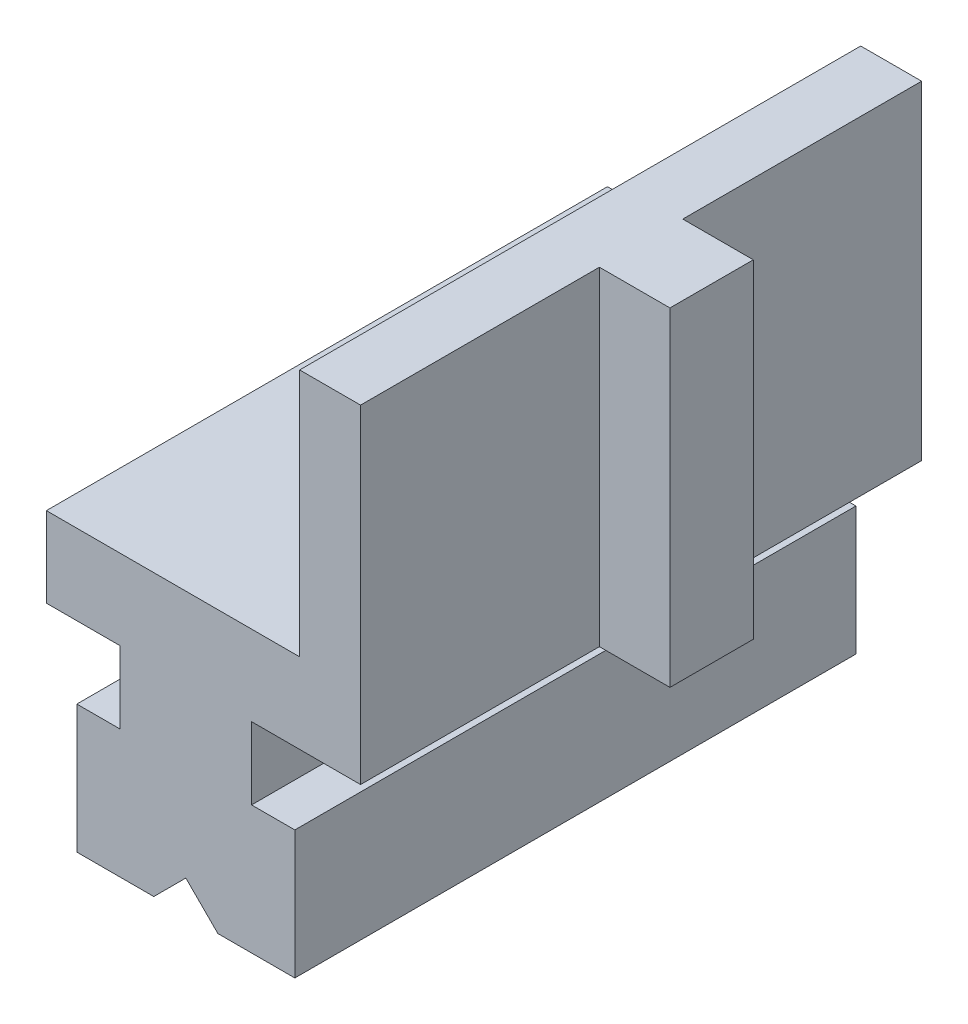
ISO-10303-21;
HEADER;
FILE_DESCRIPTION(('STEP AP214'),'2;1');
FILE_NAME('part.step','',(''),(''),'','','');
FILE_SCHEMA(('AUTOMOTIVE_DESIGN { 1 0 10303 214 1 1 1 1 }'));
ENDSEC;
DATA;
#1=APPLICATION_CONTEXT('core data for automotive mechanical design processes');
#2=APPLICATION_PROTOCOL_DEFINITION('international standard','automotive_design',2000,#1);
#3=PRODUCT_CONTEXT('',#1,'mechanical');
#4=PRODUCT('Part','Part','',(#3));
#5=PRODUCT_RELATED_PRODUCT_CATEGORY('part','',(#4));
#6=PRODUCT_DEFINITION_FORMATION('','',#4);
#7=PRODUCT_DEFINITION_CONTEXT('part definition',#1,'design');
#8=PRODUCT_DEFINITION('design','',#6,#7);
#9=PRODUCT_DEFINITION_SHAPE('','',#8);
#10=(LENGTH_UNIT() NAMED_UNIT(*) SI_UNIT(.MILLI.,.METRE.));
#11=(NAMED_UNIT(*) PLANE_ANGLE_UNIT() SI_UNIT($,.RADIAN.));
#12=(NAMED_UNIT(*) SI_UNIT($,.STERADIAN.) SOLID_ANGLE_UNIT());
#13=UNCERTAINTY_MEASURE_WITH_UNIT(LENGTH_MEASURE(1.E-05),#10,'distance_accuracy_value','');
#14=(GEOMETRIC_REPRESENTATION_CONTEXT(3) GLOBAL_UNCERTAINTY_ASSIGNED_CONTEXT((#13)) GLOBAL_UNIT_ASSIGNED_CONTEXT((#10,
#11,#12)) REPRESENTATION_CONTEXT('',''));
#15=CARTESIAN_POINT('',(0.,0.,0.));
#16=DIRECTION('',(0.,0.,1.));
#17=DIRECTION('',(1.,0.,0.));
#18=AXIS2_PLACEMENT_3D('',#15,#16,#17);
#19=CARTESIAN_POINT('',(15.3000049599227,20.5000076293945,-2.6));
#20=DIRECTION('',(0.,0.,1.));
#21=DIRECTION('',(1.,0.,0.));
#22=AXIS2_PLACEMENT_3D('',#19,#20,#21);
#23=PLANE('',#22);
#24=DIRECTION('',(1.,0.,0.));
#25=VECTOR('',#24,1.);
#26=CARTESIAN_POINT('',(7.10000801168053,20.5000076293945,-2.6));
#27=LINE('',#26,#25);
#28=CARTESIAN_POINT('',(15.3000049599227,20.5000076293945,-2.6));
#29=VERTEX_POINT('',#28);
#30=CARTESIAN_POINT('',(10.9000049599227,20.5000076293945,-2.6));
#31=VERTEX_POINT('',#30);
#32=EDGE_CURVE('E124',#29,#31,#27,.F.);
#33=ORIENTED_EDGE('',*,*,#32,.F.);
#34=DIRECTION('',(-3.72165448E-07,0.999999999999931,0.));
#35=VECTOR('',#34,1.);
#36=CARTESIAN_POINT('',(15.3000049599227,20.5000076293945,-2.6));
#37=LINE('',#36,#35);
#38=CARTESIAN_POINT('',(15.3000125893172,0.,-2.6));
#39=VERTEX_POINT('',#38);
#40=EDGE_CURVE('E18',#39,#29,#37,.T.);
#41=ORIENTED_EDGE('',*,*,#40,.F.);
#42=DIRECTION('',(1.,0.,0.));
#43=VECTOR('',#42,1.);
#44=CARTESIAN_POINT('',(15.3000125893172,0.,-2.6));
#45=LINE('',#44,#43);
#46=CARTESIAN_POINT('',(10.9000125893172,-8.18763986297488E-07,-2.59999999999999));
#47=VERTEX_POINT('',#46);
#48=EDGE_CURVE('E121',#47,#39,#45,.T.);
#49=ORIENTED_EDGE('',*,*,#48,.F.);
#50=DIRECTION('',(-3.72165448E-07,0.999999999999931,0.));
#51=VECTOR('',#50,1.);
#52=CARTESIAN_POINT('',(10.9000087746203,10.2500021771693,-2.59999999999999));
#53=LINE('',#52,#51);
#54=EDGE_CURVE('E264',#31,#47,#53,.F.);
#55=ORIENTED_EDGE('',*,*,#54,.F.);
#56=EDGE_LOOP('',(#33,#41,#49,#55));
#57=FACE_BOUND('',#56,.T.);
#58=ADVANCED_FACE('F15',(#57),#23,.F.);
#59=CARTESIAN_POINT('',(15.3000125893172,0.,2.6));
#60=DIRECTION('',(0.,0.,-1.));
#61=DIRECTION('',(-1.,0.,0.));
#62=AXIS2_PLACEMENT_3D('',#59,#60,#61);
#63=PLANE('',#62);
#64=DIRECTION('',(1.,0.,0.));
#65=VECTOR('',#64,1.);
#66=CARTESIAN_POINT('',(15.3000125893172,0.,2.6));
#67=LINE('',#66,#65);
#68=CARTESIAN_POINT('',(15.3000125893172,0.,2.6));
#69=VERTEX_POINT('',#68);
#70=CARTESIAN_POINT('',(10.9000125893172,0.,2.6));
#71=VERTEX_POINT('',#70);
#72=EDGE_CURVE('E135',#69,#71,#67,.F.);
#73=ORIENTED_EDGE('',*,*,#72,.F.);
#74=DIRECTION('',(-3.72165448E-07,0.999999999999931,0.));
#75=VECTOR('',#74,1.);
#76=CARTESIAN_POINT('',(15.3000049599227,20.5000076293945,2.6));
#77=LINE('',#76,#75);
#78=CARTESIAN_POINT('',(15.3000049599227,20.5000076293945,2.6));
#79=VERTEX_POINT('',#78);
#80=EDGE_CURVE('E128',#79,#69,#77,.F.);
#81=ORIENTED_EDGE('',*,*,#80,.F.);
#82=DIRECTION('',(1.,0.,0.));
#83=VECTOR('',#82,1.);
#84=CARTESIAN_POINT('',(7.10000801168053,20.5000076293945,2.6));
#85=LINE('',#84,#83);
#86=CARTESIAN_POINT('',(10.9000049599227,20.5000076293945,2.6));
#87=VERTEX_POINT('',#86);
#88=EDGE_CURVE('E201',#87,#79,#85,.T.);
#89=ORIENTED_EDGE('',*,*,#88,.F.);
#90=DIRECTION('',(-3.72165448E-07,0.999999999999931,0.));
#91=VECTOR('',#90,1.);
#92=CARTESIAN_POINT('',(10.9000087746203,10.2500021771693,2.59999999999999));
#93=LINE('',#92,#91);
#94=EDGE_CURVE('E149',#71,#87,#93,.T.);
#95=ORIENTED_EDGE('',*,*,#94,.F.);
#96=EDGE_LOOP('',(#73,#81,#89,#95));
#97=FACE_BOUND('',#96,.T.);
#98=ADVANCED_FACE('F376',(#97),#63,.F.);
#99=CARTESIAN_POINT('',(15.3000049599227,20.5000076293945,0.));
#100=DIRECTION('',(0.999999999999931,3.72165448E-07,0.));
#101=DIRECTION('',(-3.72165448E-07,0.999999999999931,0.));
#102=AXIS2_PLACEMENT_3D('',#99,#100,#101);
#103=PLANE('',#102);
#104=ORIENTED_EDGE('',*,*,#80,.T.);
#105=DIRECTION('',(0.,0.,-1.));
#106=VECTOR('',#105,1.);
#107=CARTESIAN_POINT('',(15.3000125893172,0.,0.));
#108=LINE('',#107,#106);
#109=EDGE_CURVE('E130',#39,#69,#108,.F.);
#110=ORIENTED_EDGE('',*,*,#109,.F.);
#111=ORIENTED_EDGE('',*,*,#40,.T.);
#112=DIRECTION('',(0.,0.,1.));
#113=VECTOR('',#112,1.);
#114=CARTESIAN_POINT('',(15.3000049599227,20.5000076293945,0.));
#115=LINE('',#114,#113);
#116=EDGE_CURVE('E231',#79,#29,#115,.F.);
#117=ORIENTED_EDGE('',*,*,#116,.F.);
#118=EDGE_LOOP('',(#104,#110,#111,#117));
#119=FACE_BOUND('',#118,.T.);
#120=ADVANCED_FACE('F131',(#119),#103,.T.);
#121=CARTESIAN_POINT('',(10.9000087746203,10.2500021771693,10.05));
#122=DIRECTION('',(0.999999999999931,3.72165448E-07,0.));
#123=DIRECTION('',(-3.72165448E-07,0.999999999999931,0.));
#124=AXIS2_PLACEMENT_3D('',#121,#122,#123);
#125=PLANE('',#124);
#126=DIRECTION('',(-3.72165448E-07,0.999999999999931,0.));
#127=VECTOR('',#126,1.);
#128=CARTESIAN_POINT('',(10.9000116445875,2.53846630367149,17.5));
#129=LINE('',#128,#127);
#130=CARTESIAN_POINT('',(10.9000125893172,0.,17.5));
#131=VERTEX_POINT('',#130);
#132=CARTESIAN_POINT('',(10.9000049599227,20.5000076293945,17.5));
#133=VERTEX_POINT('',#132);
#134=EDGE_CURVE('E206',#131,#133,#129,.T.);
#135=ORIENTED_EDGE('',*,*,#134,.F.);
#136=DIRECTION('',(0.,0.,-1.));
#137=VECTOR('',#136,1.);
#138=CARTESIAN_POINT('',(10.9000125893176,0.,0.));
#139=LINE('',#138,#137);
#140=EDGE_CURVE('E208',#71,#131,#139,.F.);
#141=ORIENTED_EDGE('',*,*,#140,.F.);
#142=ORIENTED_EDGE('',*,*,#94,.T.);
#143=DIRECTION('',(0.,0.,1.));
#144=VECTOR('',#143,1.);
#145=CARTESIAN_POINT('',(10.900004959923,20.5000076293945,0.));
#146=LINE('',#145,#144);
#147=EDGE_CURVE('E198',#133,#87,#146,.F.);
#148=ORIENTED_EDGE('',*,*,#147,.F.);
#149=EDGE_LOOP('',(#135,#141,#142,#148));
#150=FACE_BOUND('',#149,.T.);
#151=ADVANCED_FACE('F374',(#150),#125,.T.);
#152=CARTESIAN_POINT('',(1.99999409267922,-12.5,17.5));
#153=DIRECTION('',(0.707106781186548,0.707106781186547,0.));
#154=DIRECTION('',(-0.707106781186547,0.707106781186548,0.));
#155=AXIS2_PLACEMENT_3D('',#152,#153,#154);
#156=PLANE('',#155);
#157=DIRECTION('',(0.,0.,-1.));
#158=VECTOR('',#157,1.);
#159=CARTESIAN_POINT('',(1.99999409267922,-12.5,0.));
#160=LINE('',#159,#158);
#161=CARTESIAN_POINT('',(1.99999409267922,-12.5,17.5));
#162=VERTEX_POINT('',#161);
#163=CARTESIAN_POINT('',(1.99999409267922,-12.5,-17.5));
#164=VERTEX_POINT('',#163);
#165=EDGE_CURVE('E150',#162,#164,#160,.T.);
#166=ORIENTED_EDGE('',*,*,#165,.F.);
#167=DIRECTION('',(0.707106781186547,-0.707106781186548,0.));
#168=VECTOR('',#167,1.);
#169=CARTESIAN_POINT('',(-5.90732077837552E-06,-10.5,17.5));
#170=LINE('',#169,#168);
#171=CARTESIAN_POINT('',(-5.90732077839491E-06,-10.5,17.5));
#172=VERTEX_POINT('',#171);
#173=EDGE_CURVE('E222',#172,#162,#170,.T.);
#174=ORIENTED_EDGE('',*,*,#173,.F.);
#175=DIRECTION('',(0.,0.,1.));
#176=VECTOR('',#175,1.);
#177=CARTESIAN_POINT('',(-5.907320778E-06,-10.5,17.5));
#178=LINE('',#177,#176);
#179=CARTESIAN_POINT('',(-5.90732077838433E-06,-10.5,-17.5));
#180=VERTEX_POINT('',#179);
#181=EDGE_CURVE('E177',#172,#180,#178,.F.);
#182=ORIENTED_EDGE('',*,*,#181,.T.);
#183=DIRECTION('',(0.707106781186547,-0.707106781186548,0.));
#184=VECTOR('',#183,1.);
#185=CARTESIAN_POINT('',(-5.90732077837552E-06,-10.5,-17.5));
#186=LINE('',#185,#184);
#187=EDGE_CURVE('E168',#180,#164,#186,.T.);
#188=ORIENTED_EDGE('',*,*,#187,.T.);
#189=EDGE_LOOP('',(#166,#174,#182,#188));
#190=FACE_BOUND('',#189,.T.);
#191=ADVANCED_FACE('F434',(#190),#156,.F.);
#192=CARTESIAN_POINT('',(6.80000495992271,-12.5,0.));
#193=DIRECTION('',(0.,-1.,0.));
#194=DIRECTION('',(0.,0.,-1.));
#195=AXIS2_PLACEMENT_3D('',#192,#193,#194);
#196=PLANE('',#195);
#197=DIRECTION('',(0.,0.,-1.));
#198=VECTOR('',#197,1.);
#199=CARTESIAN_POINT('',(6.80000495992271,-12.5,0.));
#200=LINE('',#199,#198);
#201=CARTESIAN_POINT('',(6.80000495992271,-12.5,17.5));
#202=VERTEX_POINT('',#201);
#203=CARTESIAN_POINT('',(6.80000495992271,-12.5,-17.5));
#204=VERTEX_POINT('',#203);
#205=EDGE_CURVE('E155',#202,#204,#200,.T.);
#206=ORIENTED_EDGE('',*,*,#205,.F.);
#207=DIRECTION('',(1.,0.,0.));
#208=VECTOR('',#207,1.);
#209=CARTESIAN_POINT('',(4.31571110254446,-12.5,17.5));
#210=LINE('',#209,#208);
#211=EDGE_CURVE('E219',#162,#202,#210,.T.);
#212=ORIENTED_EDGE('',*,*,#211,.F.);
#213=ORIENTED_EDGE('',*,*,#165,.T.);
#214=DIRECTION('',(1.,0.,0.));
#215=VECTOR('',#214,1.);
#216=CARTESIAN_POINT('',(4.31571110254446,-12.5,-17.5));
#217=LINE('',#216,#215);
#218=EDGE_CURVE('E167',#164,#204,#217,.T.);
#219=ORIENTED_EDGE('',*,*,#218,.T.);
#220=EDGE_LOOP('',(#206,#212,#213,#219));
#221=FACE_BOUND('',#220,.T.);
#222=ADVANCED_FACE('F291',(#221),#196,.T.);
#223=CARTESIAN_POINT('',(6.80000495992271,-4.50001525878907,0.));
#224=DIRECTION('',(1.,0.,0.));
#225=DIRECTION('',(0.,0.,-1.));
#226=AXIS2_PLACEMENT_3D('',#223,#224,#225);
#227=PLANE('',#226);
#228=DIRECTION('',(0.,1.,0.));
#229=VECTOR('',#228,1.);
#230=CARTESIAN_POINT('',(6.80000495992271,2.53846385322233,-17.5));
#231=LINE('',#230,#229);
#232=CARTESIAN_POINT('',(6.80000495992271,-4.50001525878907,-17.5));
#233=VERTEX_POINT('',#232);
#234=EDGE_CURVE('E281',#204,#233,#231,.T.);
#235=ORIENTED_EDGE('',*,*,#234,.T.);
#236=DIRECTION('',(0.,0.,1.));
#237=VECTOR('',#236,1.);
#238=CARTESIAN_POINT('',(6.80000495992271,-4.50001525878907,0.));
#239=LINE('',#238,#237);
#240=CARTESIAN_POINT('',(6.80000495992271,-4.50001525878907,17.5));
#241=VERTEX_POINT('',#240);
#242=EDGE_CURVE('E144',#241,#233,#239,.F.);
#243=ORIENTED_EDGE('',*,*,#242,.F.);
#244=DIRECTION('',(0.,1.,0.));
#245=VECTOR('',#244,1.);
#246=CARTESIAN_POINT('',(6.80000495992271,2.53846385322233,17.5));
#247=LINE('',#246,#245);
#248=EDGE_CURVE('E216',#202,#241,#247,.T.);
#249=ORIENTED_EDGE('',*,*,#248,.F.);
#250=ORIENTED_EDGE('',*,*,#205,.T.);
#251=EDGE_LOOP('',(#235,#243,#249,#250));
#252=FACE_BOUND('',#251,.T.);
#253=ADVANCED_FACE('F296',(#252),#227,.T.);
#254=CARTESIAN_POINT('',(4.100000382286,-4.5,0.));
#255=DIRECTION('',(5.651393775E-06,0.999999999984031,0.));
#256=DIRECTION('',(-0.999999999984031,5.651393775E-06,0.));
#257=AXIS2_PLACEMENT_3D('',#254,#255,#256);
#258=PLANE('',#257);
#259=DIRECTION('',(-0.999999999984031,5.65139377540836E-06,0.));
#260=VECTOR('',#259,1.);
#261=CARTESIAN_POINT('',(6.80000495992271,-4.50001525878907,-17.5));
#262=LINE('',#261,#260);
#263=CARTESIAN_POINT('',(4.100000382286,-4.5,-17.5));
#264=VERTEX_POINT('',#263);
#265=EDGE_CURVE('E277',#233,#264,#262,.T.);
#266=ORIENTED_EDGE('',*,*,#265,.T.);
#267=DIRECTION('',(0.,0.,-1.));
#268=VECTOR('',#267,1.);
#269=CARTESIAN_POINT('',(4.100000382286,-4.5,0.));
#270=LINE('',#269,#268);
#271=CARTESIAN_POINT('',(4.100000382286,-4.5,17.5));
#272=VERTEX_POINT('',#271);
#273=EDGE_CURVE('E141',#272,#264,#270,.T.);
#274=ORIENTED_EDGE('',*,*,#273,.F.);
#275=DIRECTION('',(-0.999999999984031,5.65139377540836E-06,0.));
#276=VECTOR('',#275,1.);
#277=CARTESIAN_POINT('',(6.80000495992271,-4.50001525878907,17.5));
#278=LINE('',#277,#276);
#279=EDGE_CURVE('E213',#241,#272,#278,.T.);
#280=ORIENTED_EDGE('',*,*,#279,.F.);
#281=ORIENTED_EDGE('',*,*,#242,.T.);
#282=EDGE_LOOP('',(#266,#274,#280,#281));
#283=FACE_BOUND('',#282,.T.);
#284=ADVANCED_FACE('F305',(#283),#258,.T.);
#285=CARTESIAN_POINT('',(4.100000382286,0.,0.));
#286=DIRECTION('',(1.,0.,0.));
#287=DIRECTION('',(0.,0.,-1.));
#288=AXIS2_PLACEMENT_3D('',#285,#286,#287);
#289=PLANE('',#288);
#290=DIRECTION('',(0.,1.,0.));
#291=VECTOR('',#290,1.);
#292=CARTESIAN_POINT('',(4.100000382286,2.53846385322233,-17.5));
#293=LINE('',#292,#291);
#294=CARTESIAN_POINT('',(4.100000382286,0.,-17.5));
#295=VERTEX_POINT('',#294);
#296=EDGE_CURVE('E275',#264,#295,#293,.T.);
#297=ORIENTED_EDGE('',*,*,#296,.T.);
#298=DIRECTION('',(0.,0.,-1.));
#299=VECTOR('',#298,1.);
#300=CARTESIAN_POINT('',(4.100000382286,0.,0.));
#301=LINE('',#300,#299);
#302=CARTESIAN_POINT('',(4.100000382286,0.,17.5));
#303=VERTEX_POINT('',#302);
#304=EDGE_CURVE('E210',#303,#295,#301,.T.);
#305=ORIENTED_EDGE('',*,*,#304,.F.);
#306=DIRECTION('',(0.,1.,0.));
#307=VECTOR('',#306,1.);
#308=CARTESIAN_POINT('',(4.100000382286,2.53846385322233,17.5));
#309=LINE('',#308,#307);
#310=EDGE_CURVE('E207',#272,#303,#309,.T.);
#311=ORIENTED_EDGE('',*,*,#310,.F.);
#312=ORIENTED_EDGE('',*,*,#273,.T.);
#313=EDGE_LOOP('',(#297,#305,#311,#312));
#314=FACE_BOUND('',#313,.T.);
#315=ADVANCED_FACE('F311',(#314),#289,.T.);
#316=CARTESIAN_POINT('',(15.3000125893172,0.,0.));
#317=DIRECTION('',(0.,-1.,0.));
#318=DIRECTION('',(0.,0.,-1.));
#319=AXIS2_PLACEMENT_3D('',#316,#317,#318);
#320=PLANE('',#319);
#321=DIRECTION('',(1.,0.,0.));
#322=VECTOR('',#321,1.);
#323=CARTESIAN_POINT('',(4.31571110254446,0.,-17.5));
#324=LINE('',#323,#322);
#325=CARTESIAN_POINT('',(10.9000125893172,-8.18763986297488E-07,-17.5));
#326=VERTEX_POINT('',#325);
#327=EDGE_CURVE('E251',#295,#326,#324,.T.);
#328=ORIENTED_EDGE('',*,*,#327,.T.);
#329=DIRECTION('',(0.,0.,1.));
#330=VECTOR('',#329,1.);
#331=CARTESIAN_POINT('',(10.9000125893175,-1.63752797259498E-06,-10.05));
#332=LINE('',#331,#330);
#333=EDGE_CURVE('E139',#47,#326,#332,.F.);
#334=ORIENTED_EDGE('',*,*,#333,.F.);
#335=ORIENTED_EDGE('',*,*,#48,.T.);
#336=ORIENTED_EDGE('',*,*,#109,.T.);
#337=ORIENTED_EDGE('',*,*,#72,.T.);
#338=ORIENTED_EDGE('',*,*,#140,.T.);
#339=DIRECTION('',(1.,0.,0.));
#340=VECTOR('',#339,1.);
#341=CARTESIAN_POINT('',(4.31571110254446,0.,17.5));
#342=LINE('',#341,#340);
#343=EDGE_CURVE('E203',#303,#131,#342,.T.);
#344=ORIENTED_EDGE('',*,*,#343,.F.);
#345=ORIENTED_EDGE('',*,*,#304,.T.);
#346=EDGE_LOOP('',(#328,#334,#335,#336,#337,#338,#344,#345));
#347=FACE_BOUND('',#346,.T.);
#348=ADVANCED_FACE('F137',(#347),#320,.T.);
#349=CARTESIAN_POINT('',(10.9000087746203,10.2500021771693,-10.05));
#350=DIRECTION('',(0.999999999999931,3.72165448E-07,0.));
#351=DIRECTION('',(-3.72165448E-07,0.999999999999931,0.));
#352=AXIS2_PLACEMENT_3D('',#349,#350,#351);
#353=PLANE('',#352);
#354=ORIENTED_EDGE('',*,*,#54,.T.);
#355=ORIENTED_EDGE('',*,*,#333,.T.);
#356=DIRECTION('',(-3.72165448E-07,0.999999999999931,0.));
#357=VECTOR('',#356,1.);
#358=CARTESIAN_POINT('',(10.9000087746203,10.2500021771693,-17.5));
#359=LINE('',#358,#357);
#360=CARTESIAN_POINT('',(10.9000049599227,20.5000076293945,-17.5));
#361=VERTEX_POINT('',#360);
#362=EDGE_CURVE('E249',#326,#361,#359,.T.);
#363=ORIENTED_EDGE('',*,*,#362,.T.);
#364=DIRECTION('',(0.,0.,1.));
#365=VECTOR('',#364,1.);
#366=CARTESIAN_POINT('',(10.900004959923,20.5000076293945,0.));
#367=LINE('',#366,#365);
#368=EDGE_CURVE('E202',#31,#361,#367,.F.);
#369=ORIENTED_EDGE('',*,*,#368,.F.);
#370=EDGE_LOOP('',(#354,#355,#363,#369));
#371=FACE_BOUND('',#370,.T.);
#372=ADVANCED_FACE('F360',(#371),#353,.T.);
#373=CARTESIAN_POINT('',(7.10000801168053,20.5000076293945,0.));
#374=DIRECTION('',(0.,1.,0.));
#375=DIRECTION('',(0.,0.,1.));
#376=AXIS2_PLACEMENT_3D('',#373,#374,#375);
#377=PLANE('',#376);
#378=ORIENTED_EDGE('',*,*,#88,.T.);
#379=ORIENTED_EDGE('',*,*,#116,.T.);
#380=ORIENTED_EDGE('',*,*,#32,.T.);
#381=ORIENTED_EDGE('',*,*,#368,.T.);
#382=DIRECTION('',(1.,0.,0.));
#383=VECTOR('',#382,1.);
#384=CARTESIAN_POINT('',(7.10000801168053,20.5000076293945,-17.5));
#385=LINE('',#384,#383);
#386=CARTESIAN_POINT('',(7.10000801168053,20.5000076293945,-17.5));
#387=VERTEX_POINT('',#386);
#388=EDGE_CURVE('E247',#361,#387,#385,.F.);
#389=ORIENTED_EDGE('',*,*,#388,.T.);
#390=DIRECTION('',(0.,0.,1.));
#391=VECTOR('',#390,1.);
#392=CARTESIAN_POINT('',(7.10000801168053,20.5000076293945,0.));
#393=LINE('',#392,#391);
#394=CARTESIAN_POINT('',(7.10000801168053,20.5000076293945,17.5));
#395=VERTEX_POINT('',#394);
#396=EDGE_CURVE('E171',#395,#387,#393,.F.);
#397=ORIENTED_EDGE('',*,*,#396,.F.);
#398=DIRECTION('',(-1.,0.,0.));
#399=VECTOR('',#398,1.);
#400=CARTESIAN_POINT('',(4.31571110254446,20.5000076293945,17.5));
#401=LINE('',#400,#399);
#402=EDGE_CURVE('E258',#133,#395,#401,.T.);
#403=ORIENTED_EDGE('',*,*,#402,.F.);
#404=ORIENTED_EDGE('',*,*,#147,.T.);
#405=EDGE_LOOP('',(#378,#379,#380,#381,#389,#397,#403,#404));
#406=FACE_BOUND('',#405,.T.);
#407=ADVANCED_FACE('F365',(#406),#377,.T.);
#408=CARTESIAN_POINT('',(-4.10000493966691,-4.49998474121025,0.));
#409=DIRECTION('',(-0.999999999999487,1.012934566E-06,0.));
#410=DIRECTION('',(-1.012934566E-06,-0.999999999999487,0.));
#411=AXIS2_PLACEMENT_3D('',#408,#409,#410);
#412=PLANE('',#411);
#413=DIRECTION('',(0.,1.,0.));
#414=VECTOR('',#413,1.);
#415=CARTESIAN_POINT('',(-4.10000038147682,2.53846385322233,-17.5));
#416=LINE('',#415,#414);
#417=CARTESIAN_POINT('',(-4.10000038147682,0.,-17.5));
#418=VERTEX_POINT('',#417);
#419=CARTESIAN_POINT('',(-4.10000266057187,-4.49998474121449,-17.5));
#420=VERTEX_POINT('',#419);
#421=EDGE_CURVE('E242',#418,#420,#416,.F.);
#422=ORIENTED_EDGE('',*,*,#421,.T.);
#423=DIRECTION('',(0.,0.,1.));
#424=VECTOR('',#423,1.);
#425=CARTESIAN_POINT('',(-4.10000493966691,-4.49998474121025,0.));
#426=LINE('',#425,#424);
#427=CARTESIAN_POINT('',(-4.10000266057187,-4.49998474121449,17.5));
#428=VERTEX_POINT('',#427);
#429=EDGE_CURVE('E232',#428,#420,#426,.F.);
#430=ORIENTED_EDGE('',*,*,#429,.F.);
#431=DIRECTION('',(0.,1.,0.));
#432=VECTOR('',#431,1.);
#433=CARTESIAN_POINT('',(-4.10000038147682,2.53846385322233,17.5));
#434=LINE('',#433,#432);
#435=CARTESIAN_POINT('',(-4.10000038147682,0.,17.5));
#436=VERTEX_POINT('',#435);
#437=EDGE_CURVE('E193',#436,#428,#434,.F.);
#438=ORIENTED_EDGE('',*,*,#437,.F.);
#439=DIRECTION('',(0.,0.,1.));
#440=VECTOR('',#439,1.);
#441=CARTESIAN_POINT('',(-4.10000038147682,0.,0.));
#442=LINE('',#441,#440);
#443=EDGE_CURVE('E180',#418,#436,#442,.T.);
#444=ORIENTED_EDGE('',*,*,#443,.F.);
#445=EDGE_LOOP('',(#422,#430,#438,#444));
#446=FACE_BOUND('',#445,.T.);
#447=ADVANCED_FACE('F415',(#446),#412,.T.);
#448=CARTESIAN_POINT('',(-6.80000188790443,-4.49997971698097,0.));
#449=DIRECTION('',(1.860827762E-06,0.999999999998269,0.));
#450=DIRECTION('',(-0.999999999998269,1.860827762E-06,0.));
#451=AXIS2_PLACEMENT_3D('',#448,#449,#450);
#452=PLANE('',#451);
#453=DIRECTION('',(-0.999999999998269,1.860827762E-06,0.));
#454=VECTOR('',#453,1.);
#455=CARTESIAN_POINT('',(-6.80000188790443,-4.49997971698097,-17.5));
#456=LINE('',#455,#454);
#457=CARTESIAN_POINT('',(-6.80000188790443,-4.49997971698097,-17.5));
#458=VERTEX_POINT('',#457);
#459=EDGE_CURVE('E240',#420,#458,#456,.T.);
#460=ORIENTED_EDGE('',*,*,#459,.T.);
#461=DIRECTION('',(0.,0.,1.));
#462=VECTOR('',#461,1.);
#463=CARTESIAN_POINT('',(-6.80000188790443,-4.49997971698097,0.));
#464=LINE('',#463,#462);
#465=CARTESIAN_POINT('',(-6.80000188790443,-4.49997971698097,17.5));
#466=VERTEX_POINT('',#465);
#467=EDGE_CURVE('E346',#466,#458,#464,.F.);
#468=ORIENTED_EDGE('',*,*,#467,.F.);
#469=DIRECTION('',(-0.999999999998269,1.860827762E-06,0.));
#470=VECTOR('',#469,1.);
#471=CARTESIAN_POINT('',(4.31569800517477,-4.50000040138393,17.5));
#472=LINE('',#471,#470);
#473=EDGE_CURVE('E196',#428,#466,#472,.T.);
#474=ORIENTED_EDGE('',*,*,#473,.F.);
#475=ORIENTED_EDGE('',*,*,#429,.T.);
#476=EDGE_LOOP('',(#460,#468,#474,#475));
#477=FACE_BOUND('',#476,.T.);
#478=ADVANCED_FACE('F412',(#477),#452,.T.);
#479=CARTESIAN_POINT('',(-6.80001677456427,-12.5,0.));
#480=DIRECTION('',(-0.999999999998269,1.860827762E-06,0.));
#481=DIRECTION('',(-1.860827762E-06,-0.999999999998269,0.));
#482=AXIS2_PLACEMENT_3D('',#479,#480,#481);
#483=PLANE('',#482);
#484=DIRECTION('',(-1.860827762E-06,-0.999999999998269,0.));
#485=VECTOR('',#484,1.);
#486=CARTESIAN_POINT('',(-6.80001677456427,-12.5,-17.5));
#487=LINE('',#486,#485);
#488=CARTESIAN_POINT('',(-6.80001677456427,-12.5,-17.5));
#489=VERTEX_POINT('',#488);
#490=EDGE_CURVE('E238',#458,#489,#487,.T.);
#491=ORIENTED_EDGE('',*,*,#490,.T.);
#492=DIRECTION('',(0.,0.,-1.));
#493=VECTOR('',#492,1.);
#494=CARTESIAN_POINT('',(-6.80001677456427,-12.5,0.));
#495=LINE('',#494,#493);
#496=CARTESIAN_POINT('',(-6.80001677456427,-12.5,17.5));
#497=VERTEX_POINT('',#496);
#498=EDGE_CURVE('E230',#497,#489,#495,.T.);
#499=ORIENTED_EDGE('',*,*,#498,.F.);
#500=DIRECTION('',(-1.8608277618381E-06,-0.999999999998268,0.));
#501=VECTOR('',#500,1.);
#502=CARTESIAN_POINT('',(-6.80000188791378,-4.49998474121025,17.5));
#503=LINE('',#502,#501);
#504=EDGE_CURVE('E192',#466,#497,#503,.T.);
#505=ORIENTED_EDGE('',*,*,#504,.F.);
#506=ORIENTED_EDGE('',*,*,#467,.T.);
#507=EDGE_LOOP('',(#491,#499,#505,#506));
#508=FACE_BOUND('',#507,.T.);
#509=ADVANCED_FACE('F345',(#508),#483,.T.);
#510=CARTESIAN_POINT('',(6.80000495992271,-12.5,0.));
#511=DIRECTION('',(0.,-1.,0.));
#512=DIRECTION('',(0.,0.,-1.));
#513=AXIS2_PLACEMENT_3D('',#510,#511,#512);
#514=PLANE('',#513);
#515=ORIENTED_EDGE('',*,*,#498,.T.);
#516=DIRECTION('',(1.,0.,0.));
#517=VECTOR('',#516,1.);
#518=CARTESIAN_POINT('',(4.31571110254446,-12.5,-17.5));
#519=LINE('',#518,#517);
#520=CARTESIAN_POINT('',(-2.00000590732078,-12.5,-17.5));
#521=VERTEX_POINT('',#520);
#522=EDGE_CURVE('E176',#489,#521,#519,.T.);
#523=ORIENTED_EDGE('',*,*,#522,.T.);
#524=DIRECTION('',(0.,0.,1.));
#525=VECTOR('',#524,1.);
#526=CARTESIAN_POINT('',(-2.00000590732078,-12.5,17.5));
#527=LINE('',#526,#525);
#528=CARTESIAN_POINT('',(-2.00000590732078,-12.5,17.5));
#529=VERTEX_POINT('',#528);
#530=EDGE_CURVE('E181',#521,#529,#527,.T.);
#531=ORIENTED_EDGE('',*,*,#530,.T.);
#532=DIRECTION('',(1.,0.,0.));
#533=VECTOR('',#532,1.);
#534=CARTESIAN_POINT('',(4.31571110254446,-12.5,17.5));
#535=LINE('',#534,#533);
#536=EDGE_CURVE('E185',#497,#529,#535,.T.);
#537=ORIENTED_EDGE('',*,*,#536,.F.);
#538=EDGE_LOOP('',(#515,#523,#531,#537));
#539=FACE_BOUND('',#538,.T.);
#540=ADVANCED_FACE('F333',(#539),#514,.T.);
#541=CARTESIAN_POINT('',(-5.907320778E-06,-10.5,17.5));
#542=DIRECTION('',(-0.707106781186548,0.707106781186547,0.));
#543=DIRECTION('',(-0.707106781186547,-0.707106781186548,0.));
#544=AXIS2_PLACEMENT_3D('',#541,#542,#543);
#545=PLANE('',#544);
#546=ORIENTED_EDGE('',*,*,#181,.F.);
#547=DIRECTION('',(0.707106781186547,0.707106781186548,0.));
#548=VECTOR('',#547,1.);
#549=CARTESIAN_POINT('',(-2.00000590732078,-12.5,17.5));
#550=LINE('',#549,#548);
#551=EDGE_CURVE('E225',#529,#172,#550,.T.);
#552=ORIENTED_EDGE('',*,*,#551,.F.);
#553=ORIENTED_EDGE('',*,*,#530,.F.);
#554=DIRECTION('',(0.707106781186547,0.707106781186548,0.));
#555=VECTOR('',#554,1.);
#556=CARTESIAN_POINT('',(-2.00000590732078,-12.5,-17.5));
#557=LINE('',#556,#555);
#558=EDGE_CURVE('E172',#521,#180,#557,.T.);
#559=ORIENTED_EDGE('',*,*,#558,.T.);
#560=EDGE_LOOP('',(#546,#552,#553,#559));
#561=FACE_BOUND('',#560,.T.);
#562=ADVANCED_FACE('F340',(#561),#545,.F.);
#563=CARTESIAN_POINT('',(-4.10000038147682,0.,0.));
#564=DIRECTION('',(-5.177965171E-06,-0.999999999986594,0.));
#565=DIRECTION('',(0.999999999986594,-5.177965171E-06,0.));
#566=AXIS2_PLACEMENT_3D('',#563,#564,#565);
#567=PLANE('',#566);
#568=DIRECTION('',(0.999999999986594,-5.177965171E-06,0.));
#569=VECTOR('',#568,1.);
#570=CARTESIAN_POINT('',(-4.10000038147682,0.,-17.5));
#571=LINE('',#570,#569);
#572=CARTESIAN_POINT('',(-8.6999874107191,2.38185726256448E-05,-17.5));
#573=VERTEX_POINT('',#572);
#574=EDGE_CURVE('E243',#573,#418,#571,.T.);
#575=ORIENTED_EDGE('',*,*,#574,.T.);
#576=ORIENTED_EDGE('',*,*,#443,.T.);
#577=DIRECTION('',(0.999999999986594,-5.17796517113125E-06,0.));
#578=VECTOR('',#577,1.);
#579=CARTESIAN_POINT('',(-8.69999504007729,2.3818612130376E-05,17.5));
#580=LINE('',#579,#578);
#581=CARTESIAN_POINT('',(-8.6999874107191,2.38185726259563E-05,17.5));
#582=VERTEX_POINT('',#581);
#583=EDGE_CURVE('E197',#582,#436,#580,.T.);
#584=ORIENTED_EDGE('',*,*,#583,.F.);
#585=DIRECTION('',(0.,0.,1.));
#586=VECTOR('',#585,1.);
#587=CARTESIAN_POINT('',(-8.6999874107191,2.3818572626E-05,0.));
#588=LINE('',#587,#586);
#589=EDGE_CURVE('E235',#573,#582,#588,.T.);
#590=ORIENTED_EDGE('',*,*,#589,.F.);
#591=EDGE_LOOP('',(#575,#576,#584,#590));
#592=FACE_BOUND('',#591,.T.);
#593=ADVANCED_FACE('F402',(#592),#567,.T.);
#594=CARTESIAN_POINT('',(4.31571110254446,2.53846385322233,17.5));
#595=DIRECTION('',(0.,0.,1.));
#596=DIRECTION('',(1.,0.,0.));
#597=AXIS2_PLACEMENT_3D('',#594,#595,#596);
#598=PLANE('',#597);
#599=ORIENTED_EDGE('',*,*,#504,.T.);
#600=ORIENTED_EDGE('',*,*,#536,.T.);
#601=ORIENTED_EDGE('',*,*,#551,.T.);
#602=ORIENTED_EDGE('',*,*,#173,.T.);
#603=ORIENTED_EDGE('',*,*,#211,.T.);
#604=ORIENTED_EDGE('',*,*,#248,.T.);
#605=ORIENTED_EDGE('',*,*,#279,.T.);
#606=ORIENTED_EDGE('',*,*,#310,.T.);
#607=ORIENTED_EDGE('',*,*,#343,.T.);
#608=ORIENTED_EDGE('',*,*,#134,.T.);
#609=ORIENTED_EDGE('',*,*,#402,.T.);
#610=DIRECTION('',(0.,1.,0.));
#611=VECTOR('',#610,1.);
#612=CARTESIAN_POINT('',(7.10000801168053,5.00000762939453,17.5));
#613=LINE('',#612,#611);
#614=CARTESIAN_POINT('',(7.10000801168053,5.00000762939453,17.5));
#615=VERTEX_POINT('',#614);
#616=EDGE_CURVE('E182',#615,#395,#613,.T.);
#617=ORIENTED_EDGE('',*,*,#616,.F.);
#618=DIRECTION('',(1.,0.,0.));
#619=VECTOR('',#618,1.);
#620=CARTESIAN_POINT('',(-8.69999504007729,5.00000762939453,17.5));
#621=LINE('',#620,#619);
#622=CARTESIAN_POINT('',(-8.69999504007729,5.00000762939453,17.5));
#623=VERTEX_POINT('',#622);
#624=EDGE_CURVE('E189',#623,#615,#621,.T.);
#625=ORIENTED_EDGE('',*,*,#624,.F.);
#626=DIRECTION('',(1.525876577E-06,-0.999999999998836,0.));
#627=VECTOR('',#626,1.);
#628=CARTESIAN_POINT('',(-8.6999874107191,2.3818572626E-05,17.5));
#629=LINE('',#628,#627);
#630=EDGE_CURVE('E175',#582,#623,#629,.F.);
#631=ORIENTED_EDGE('',*,*,#630,.F.);
#632=ORIENTED_EDGE('',*,*,#583,.T.);
#633=ORIENTED_EDGE('',*,*,#437,.T.);
#634=ORIENTED_EDGE('',*,*,#473,.T.);
#635=EDGE_LOOP('',(#599,#600,#601,#602,#603,#604,#605,#606,#607,#608,#609,#617,#625,#631,#632,
#633,#634));
#636=FACE_BOUND('',#635,.T.);
#637=ADVANCED_FACE('F315',(#636),#598,.T.);
#638=CARTESIAN_POINT('',(7.10000801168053,5.00000762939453,0.));
#639=DIRECTION('',(-1.,0.,0.));
#640=DIRECTION('',(0.,0.,1.));
#641=AXIS2_PLACEMENT_3D('',#638,#639,#640);
#642=PLANE('',#641);
#643=DIRECTION('',(0.,1.,0.));
#644=VECTOR('',#643,1.);
#645=CARTESIAN_POINT('',(7.10000801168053,2.53846385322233,-17.5));
#646=LINE('',#645,#644);
#647=CARTESIAN_POINT('',(7.10000801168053,5.00000762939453,-17.5));
#648=VERTEX_POINT('',#647);
#649=EDGE_CURVE('E246',#387,#648,#646,.F.);
#650=ORIENTED_EDGE('',*,*,#649,.T.);
#651=DIRECTION('',(0.,0.,1.));
#652=VECTOR('',#651,1.);
#653=CARTESIAN_POINT('',(7.10000801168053,5.00000762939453,0.));
#654=LINE('',#653,#652);
#655=EDGE_CURVE('E186',#615,#648,#654,.F.);
#656=ORIENTED_EDGE('',*,*,#655,.F.);
#657=ORIENTED_EDGE('',*,*,#616,.T.);
#658=ORIENTED_EDGE('',*,*,#396,.T.);
#659=EDGE_LOOP('',(#650,#656,#657,#658));
#660=FACE_BOUND('',#659,.T.);
#661=ADVANCED_FACE('F368',(#660),#642,.T.);
#662=CARTESIAN_POINT('',(4.31571110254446,2.53846385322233,-17.5));
#663=DIRECTION('',(0.,0.,1.));
#664=DIRECTION('',(1.,0.,0.));
#665=AXIS2_PLACEMENT_3D('',#662,#663,#664);
#666=PLANE('',#665);
#667=ORIENTED_EDGE('',*,*,#522,.F.);
#668=ORIENTED_EDGE('',*,*,#490,.F.);
#669=ORIENTED_EDGE('',*,*,#459,.F.);
#670=ORIENTED_EDGE('',*,*,#421,.F.);
#671=ORIENTED_EDGE('',*,*,#574,.F.);
#672=DIRECTION('',(1.525876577E-06,-0.999999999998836,0.));
#673=VECTOR('',#672,1.);
#674=CARTESIAN_POINT('',(-8.6999874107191,2.3818572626E-05,-17.5));
#675=LINE('',#674,#673);
#676=CARTESIAN_POINT('',(-8.69999504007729,5.00000762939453,-17.5));
#677=VERTEX_POINT('',#676);
#678=EDGE_CURVE('E33',#677,#573,#675,.T.);
#679=ORIENTED_EDGE('',*,*,#678,.F.);
#680=DIRECTION('',(1.,0.,0.));
#681=VECTOR('',#680,1.);
#682=CARTESIAN_POINT('',(-8.69999504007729,5.00000762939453,-17.5));
#683=LINE('',#682,#681);
#684=EDGE_CURVE('E24',#648,#677,#683,.F.);
#685=ORIENTED_EDGE('',*,*,#684,.F.);
#686=ORIENTED_EDGE('',*,*,#649,.F.);
#687=ORIENTED_EDGE('',*,*,#388,.F.);
#688=ORIENTED_EDGE('',*,*,#362,.F.);
#689=ORIENTED_EDGE('',*,*,#327,.F.);
#690=ORIENTED_EDGE('',*,*,#296,.F.);
#691=ORIENTED_EDGE('',*,*,#265,.F.);
#692=ORIENTED_EDGE('',*,*,#234,.F.);
#693=ORIENTED_EDGE('',*,*,#218,.F.);
#694=ORIENTED_EDGE('',*,*,#187,.F.);
#695=ORIENTED_EDGE('',*,*,#558,.F.);
#696=EDGE_LOOP('',(#667,#668,#669,#670,#671,#679,#685,#686,#687,#688,#689,#690,#691,#692,#693,
#694,#695));
#697=FACE_BOUND('',#696,.T.);
#698=ADVANCED_FACE('F299',(#697),#666,.F.);
#699=CARTESIAN_POINT('',(-8.6999874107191,2.3818572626E-05,0.));
#700=DIRECTION('',(-0.999999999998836,-1.525876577E-06,0.));
#701=DIRECTION('',(1.525876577E-06,-0.999999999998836,0.));
#702=AXIS2_PLACEMENT_3D('',#699,#700,#701);
#703=PLANE('',#702);
#704=ORIENTED_EDGE('',*,*,#678,.T.);
#705=ORIENTED_EDGE('',*,*,#589,.T.);
#706=ORIENTED_EDGE('',*,*,#630,.T.);
#707=DIRECTION('',(0.,0.,1.));
#708=VECTOR('',#707,1.);
#709=CARTESIAN_POINT('',(-8.69999504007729,5.00000762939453,0.));
#710=LINE('',#709,#708);
#711=EDGE_CURVE('E10',#677,#623,#710,.T.);
#712=ORIENTED_EDGE('',*,*,#711,.F.);
#713=EDGE_LOOP('',(#704,#705,#706,#712));
#714=FACE_BOUND('',#713,.T.);
#715=ADVANCED_FACE('F386',(#714),#703,.T.);
#716=CARTESIAN_POINT('',(-8.69999504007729,5.00000762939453,0.));
#717=DIRECTION('',(0.,1.,0.));
#718=DIRECTION('',(0.,0.,1.));
#719=AXIS2_PLACEMENT_3D('',#716,#717,#718);
#720=PLANE('',#719);
#721=ORIENTED_EDGE('',*,*,#684,.T.);
#722=ORIENTED_EDGE('',*,*,#711,.T.);
#723=ORIENTED_EDGE('',*,*,#624,.T.);
#724=ORIENTED_EDGE('',*,*,#655,.T.);
#725=EDGE_LOOP('',(#721,#722,#723,#724));
#726=FACE_BOUND('',#725,.T.);
#727=ADVANCED_FACE('F384',(#726),#720,.T.);
#728=CLOSED_SHELL('',(#58,#98,#120,#151,#191,#222,#253,#284,#315,#348,#372,#407,#447,#478,#509,
#540,#562,#593,#637,#661,#698,#715,#727));
#729=MANIFOLD_SOLID_BREP('B1',#728);
#730=ADVANCED_BREP_SHAPE_REPRESENTATION('',(#18,#729),#14);
#731=SHAPE_DEFINITION_REPRESENTATION(#9,#730);
ENDSEC;
END-ISO-10303-21;
